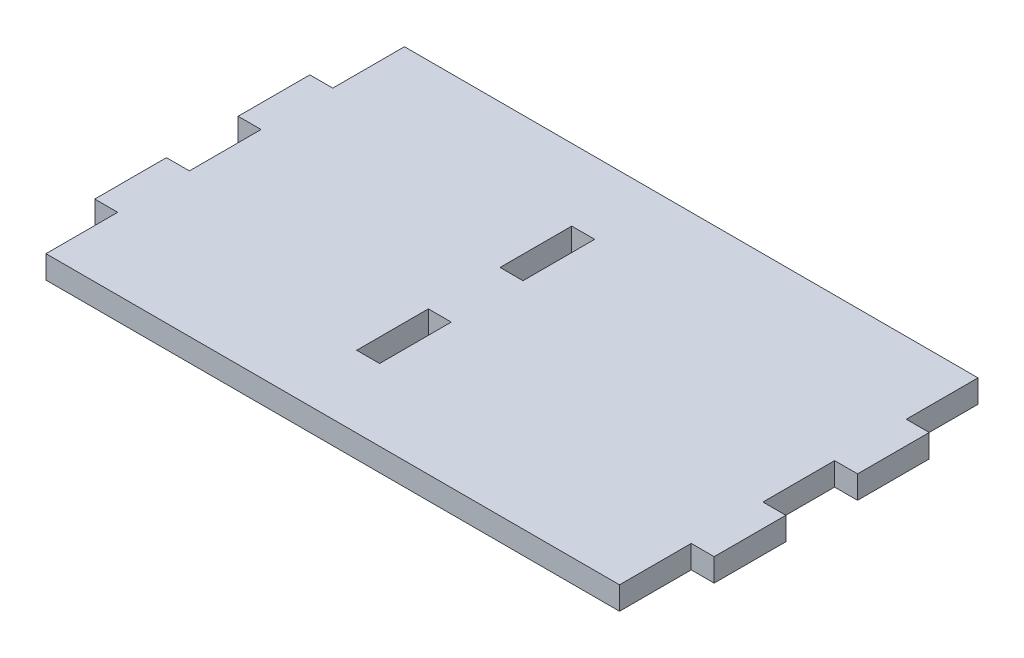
ISO-10303-21;
HEADER;
FILE_DESCRIPTION(('STEP AP214'),'2;1');
FILE_NAME('part.step','',(''),(''),'','','');
FILE_SCHEMA(('AUTOMOTIVE_DESIGN { 1 0 10303 214 1 1 1 1 }'));
ENDSEC;
DATA;
#1=APPLICATION_CONTEXT('core data for automotive mechanical design processes');
#2=APPLICATION_PROTOCOL_DEFINITION('international standard','automotive_design',2000,#1);
#3=PRODUCT_CONTEXT('',#1,'mechanical');
#4=PRODUCT('Part','Part','',(#3));
#5=PRODUCT_RELATED_PRODUCT_CATEGORY('part','',(#4));
#6=PRODUCT_DEFINITION_FORMATION('','',#4);
#7=PRODUCT_DEFINITION_CONTEXT('part definition',#1,'design');
#8=PRODUCT_DEFINITION('design','',#6,#7);
#9=PRODUCT_DEFINITION_SHAPE('','',#8);
#10=(LENGTH_UNIT() NAMED_UNIT(*) SI_UNIT(.MILLI.,.METRE.));
#11=(NAMED_UNIT(*) PLANE_ANGLE_UNIT() SI_UNIT($,.RADIAN.));
#12=(NAMED_UNIT(*) SI_UNIT($,.STERADIAN.) SOLID_ANGLE_UNIT());
#13=UNCERTAINTY_MEASURE_WITH_UNIT(LENGTH_MEASURE(1.E-05),#10,'distance_accuracy_value','');
#14=(GEOMETRIC_REPRESENTATION_CONTEXT(3) GLOBAL_UNCERTAINTY_ASSIGNED_CONTEXT((#13)) GLOBAL_UNIT_ASSIGNED_CONTEXT((#10,
#11,#12)) REPRESENTATION_CONTEXT('',''));
#15=CARTESIAN_POINT('',(0.,0.,0.));
#16=DIRECTION('',(0.,0.,1.));
#17=DIRECTION('',(1.,0.,0.));
#18=AXIS2_PLACEMENT_3D('',#15,#16,#17);
#19=CARTESIAN_POINT('',(0.,12.,0.));
#20=DIRECTION('',(0.,-1.,0.));
#21=DIRECTION('',(0.,0.,-1.));
#22=AXIS2_PLACEMENT_3D('',#19,#20,#21);
#23=PLANE('',#22);
#24=DIRECTION('',(0.,0.,1.));
#25=VECTOR('',#24,1.);
#26=CARTESIAN_POINT('',(-25.,12.,-56.25));
#27=LINE('',#26,#25);
#28=CARTESIAN_POINT('',(-25.,12.,-56.25));
#29=VERTEX_POINT('',#28);
#30=CARTESIAN_POINT('',(-25.,12.,-18.75));
#31=VERTEX_POINT('',#30);
#32=EDGE_CURVE('E279',#29,#31,#27,.T.);
#33=ORIENTED_EDGE('',*,*,#32,.F.);
#34=DIRECTION('',(-1.,0.,0.));
#35=VECTOR('',#34,1.);
#36=CARTESIAN_POINT('',(-25.,12.,-56.25));
#37=LINE('',#36,#35);
#38=CARTESIAN_POINT('',(-13.,12.,-56.25));
#39=VERTEX_POINT('',#38);
#40=EDGE_CURVE('E290',#39,#29,#37,.T.);
#41=ORIENTED_EDGE('',*,*,#40,.F.);
#42=DIRECTION('',(0.,0.,-1.));
#43=VECTOR('',#42,1.);
#44=CARTESIAN_POINT('',(-13.,12.,-56.25));
#45=LINE('',#44,#43);
#46=CARTESIAN_POINT('',(-13.,12.,-18.75));
#47=VERTEX_POINT('',#46);
#48=EDGE_CURVE('E286',#47,#39,#45,.T.);
#49=ORIENTED_EDGE('',*,*,#48,.F.);
#50=DIRECTION('',(1.,0.,0.));
#51=VECTOR('',#50,1.);
#52=CARTESIAN_POINT('',(-25.,12.,-18.75));
#53=LINE('',#52,#51);
#54=EDGE_CURVE('E282',#31,#47,#53,.T.);
#55=ORIENTED_EDGE('',*,*,#54,.F.);
#56=EDGE_LOOP('',(#33,#41,#49,#55));
#57=FACE_BOUND('',#56,.T.);
#58=DIRECTION('',(0.,0.,-1.));
#59=VECTOR('',#58,1.);
#60=CARTESIAN_POINT('',(150.,12.,-56.25));
#61=LINE('',#60,#59);
#62=CARTESIAN_POINT('',(150.,12.,-56.25));
#63=VERTEX_POINT('',#62);
#64=CARTESIAN_POINT('',(150.,12.,-93.75));
#65=VERTEX_POINT('',#64);
#66=EDGE_CURVE('E322',#63,#65,#61,.T.);
#67=ORIENTED_EDGE('',*,*,#66,.T.);
#68=DIRECTION('',(-1.,0.,0.));
#69=VECTOR('',#68,1.);
#70=CARTESIAN_POINT('',(-150.,12.,-93.75));
#71=LINE('',#70,#69);
#72=CARTESIAN_POINT('',(-150.,12.,-93.75));
#73=VERTEX_POINT('',#72);
#74=EDGE_CURVE('E326',#65,#73,#71,.T.);
#75=ORIENTED_EDGE('',*,*,#74,.T.);
#76=DIRECTION('',(0.,0.,1.));
#77=VECTOR('',#76,1.);
#78=CARTESIAN_POINT('',(-150.,12.,-56.25));
#79=LINE('',#78,#77);
#80=CARTESIAN_POINT('',(-150.,12.,-56.25));
#81=VERTEX_POINT('',#80);
#82=EDGE_CURVE('E330',#73,#81,#79,.T.);
#83=ORIENTED_EDGE('',*,*,#82,.T.);
#84=DIRECTION('',(-1.,0.,0.));
#85=VECTOR('',#84,1.);
#86=CARTESIAN_POINT('',(-150.,12.,-56.25));
#87=LINE('',#86,#85);
#88=CARTESIAN_POINT('',(-162.,12.,-56.25));
#89=VERTEX_POINT('',#88);
#90=EDGE_CURVE('E333',#81,#89,#87,.T.);
#91=ORIENTED_EDGE('',*,*,#90,.T.);
#92=DIRECTION('',(0.,0.,1.));
#93=VECTOR('',#92,1.);
#94=CARTESIAN_POINT('',(-162.,12.,-18.75));
#95=LINE('',#94,#93);
#96=CARTESIAN_POINT('',(-162.,12.,-18.75));
#97=VERTEX_POINT('',#96);
#98=EDGE_CURVE('E336',#89,#97,#95,.T.);
#99=ORIENTED_EDGE('',*,*,#98,.T.);
#100=DIRECTION('',(1.,0.,0.));
#101=VECTOR('',#100,1.);
#102=CARTESIAN_POINT('',(-150.,12.,-18.75));
#103=LINE('',#102,#101);
#104=CARTESIAN_POINT('',(-150.,12.,-18.75));
#105=VERTEX_POINT('',#104);
#106=EDGE_CURVE('E339',#97,#105,#103,.T.);
#107=ORIENTED_EDGE('',*,*,#106,.T.);
#108=DIRECTION('',(0.,0.,1.));
#109=VECTOR('',#108,1.);
#110=CARTESIAN_POINT('',(-150.,12.,18.75));
#111=LINE('',#110,#109);
#112=CARTESIAN_POINT('',(-150.,12.,18.75));
#113=VERTEX_POINT('',#112);
#114=EDGE_CURVE('E342',#105,#113,#111,.T.);
#115=ORIENTED_EDGE('',*,*,#114,.T.);
#116=DIRECTION('',(-1.,0.,0.));
#117=VECTOR('',#116,1.);
#118=CARTESIAN_POINT('',(-150.,12.,18.75));
#119=LINE('',#118,#117);
#120=CARTESIAN_POINT('',(-162.,12.,18.75));
#121=VERTEX_POINT('',#120);
#122=EDGE_CURVE('E345',#113,#121,#119,.T.);
#123=ORIENTED_EDGE('',*,*,#122,.T.);
#124=DIRECTION('',(0.,0.,1.));
#125=VECTOR('',#124,1.);
#126=CARTESIAN_POINT('',(-162.,12.,56.25));
#127=LINE('',#126,#125);
#128=CARTESIAN_POINT('',(-162.,12.,56.25));
#129=VERTEX_POINT('',#128);
#130=EDGE_CURVE('E348',#121,#129,#127,.T.);
#131=ORIENTED_EDGE('',*,*,#130,.T.);
#132=DIRECTION('',(1.,0.,0.));
#133=VECTOR('',#132,1.);
#134=CARTESIAN_POINT('',(-150.,12.,56.25));
#135=LINE('',#134,#133);
#136=CARTESIAN_POINT('',(-150.,12.,56.25));
#137=VERTEX_POINT('',#136);
#138=EDGE_CURVE('E351',#129,#137,#135,.T.);
#139=ORIENTED_EDGE('',*,*,#138,.T.);
#140=DIRECTION('',(0.,0.,1.));
#141=VECTOR('',#140,1.);
#142=CARTESIAN_POINT('',(-150.,12.,93.75));
#143=LINE('',#142,#141);
#144=CARTESIAN_POINT('',(-150.,12.,93.75));
#145=VERTEX_POINT('',#144);
#146=EDGE_CURVE('E354',#137,#145,#143,.T.);
#147=ORIENTED_EDGE('',*,*,#146,.T.);
#148=DIRECTION('',(1.,0.,0.));
#149=VECTOR('',#148,1.);
#150=CARTESIAN_POINT('',(-150.,12.,93.75));
#151=LINE('',#150,#149);
#152=CARTESIAN_POINT('',(150.,12.,93.75));
#153=VERTEX_POINT('',#152);
#154=EDGE_CURVE('E357',#145,#153,#151,.T.);
#155=ORIENTED_EDGE('',*,*,#154,.T.);
#156=DIRECTION('',(0.,0.,-1.));
#157=VECTOR('',#156,1.);
#158=CARTESIAN_POINT('',(150.,12.,93.75));
#159=LINE('',#158,#157);
#160=CARTESIAN_POINT('',(150.,12.,56.25));
#161=VERTEX_POINT('',#160);
#162=EDGE_CURVE('E360',#153,#161,#159,.T.);
#163=ORIENTED_EDGE('',*,*,#162,.T.);
#164=DIRECTION('',(1.,0.,0.));
#165=VECTOR('',#164,1.);
#166=CARTESIAN_POINT('',(150.,12.,56.25));
#167=LINE('',#166,#165);
#168=CARTESIAN_POINT('',(162.,12.,56.25));
#169=VERTEX_POINT('',#168);
#170=EDGE_CURVE('E363',#161,#169,#167,.T.);
#171=ORIENTED_EDGE('',*,*,#170,.T.);
#172=DIRECTION('',(0.,0.,-1.));
#173=VECTOR('',#172,1.);
#174=CARTESIAN_POINT('',(162.,12.,56.25));
#175=LINE('',#174,#173);
#176=CARTESIAN_POINT('',(162.,12.,18.75));
#177=VERTEX_POINT('',#176);
#178=EDGE_CURVE('E366',#169,#177,#175,.T.);
#179=ORIENTED_EDGE('',*,*,#178,.T.);
#180=DIRECTION('',(-1.,0.,0.));
#181=VECTOR('',#180,1.);
#182=CARTESIAN_POINT('',(150.,12.,18.75));
#183=LINE('',#182,#181);
#184=CARTESIAN_POINT('',(150.,12.,18.75));
#185=VERTEX_POINT('',#184);
#186=EDGE_CURVE('E369',#177,#185,#183,.T.);
#187=ORIENTED_EDGE('',*,*,#186,.T.);
#188=DIRECTION('',(0.,0.,-1.));
#189=VECTOR('',#188,1.);
#190=CARTESIAN_POINT('',(150.,12.,18.75));
#191=LINE('',#190,#189);
#192=CARTESIAN_POINT('',(150.,12.,-18.75));
#193=VERTEX_POINT('',#192);
#194=EDGE_CURVE('E372',#185,#193,#191,.T.);
#195=ORIENTED_EDGE('',*,*,#194,.T.);
#196=DIRECTION('',(1.,0.,0.));
#197=VECTOR('',#196,1.);
#198=CARTESIAN_POINT('',(150.,12.,-18.75));
#199=LINE('',#198,#197);
#200=CARTESIAN_POINT('',(162.,12.,-18.75));
#201=VERTEX_POINT('',#200);
#202=EDGE_CURVE('E375',#193,#201,#199,.T.);
#203=ORIENTED_EDGE('',*,*,#202,.T.);
#204=DIRECTION('',(0.,0.,-1.));
#205=VECTOR('',#204,1.);
#206=CARTESIAN_POINT('',(162.,12.,-18.75));
#207=LINE('',#206,#205);
#208=CARTESIAN_POINT('',(162.,12.,-56.25));
#209=VERTEX_POINT('',#208);
#210=EDGE_CURVE('E378',#201,#209,#207,.T.);
#211=ORIENTED_EDGE('',*,*,#210,.T.);
#212=DIRECTION('',(-1.,0.,0.));
#213=VECTOR('',#212,1.);
#214=CARTESIAN_POINT('',(150.,12.,-56.25));
#215=LINE('',#214,#213);
#216=EDGE_CURVE('E381',#209,#63,#215,.T.);
#217=ORIENTED_EDGE('',*,*,#216,.T.);
#218=EDGE_LOOP('',(#67,#75,#83,#91,#99,#107,#115,#123,#131,#139,#147,#155,#163,#171,#179,#187,
#195,#203,#211,#217));
#219=FACE_BOUND('',#218,.T.);
#220=DIRECTION('',(-1.,0.,0.));
#221=VECTOR('',#220,1.);
#222=CARTESIAN_POINT('',(-24.9999999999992,12.,18.75));
#223=LINE('',#222,#221);
#224=CARTESIAN_POINT('',(-12.9999999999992,12.,18.75));
#225=VERTEX_POINT('',#224);
#226=CARTESIAN_POINT('',(-24.9999999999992,12.,18.75));
#227=VERTEX_POINT('',#226);
#228=EDGE_CURVE('E231',#225,#227,#223,.T.);
#229=ORIENTED_EDGE('',*,*,#228,.F.);
#230=DIRECTION('',(0.,0.,-1.));
#231=VECTOR('',#230,1.);
#232=CARTESIAN_POINT('',(-12.9999999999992,12.,18.75));
#233=LINE('',#232,#231);
#234=CARTESIAN_POINT('',(-12.9999999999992,12.,56.25));
#235=VERTEX_POINT('',#234);
#236=EDGE_CURVE('E257',#235,#225,#233,.T.);
#237=ORIENTED_EDGE('',*,*,#236,.F.);
#238=DIRECTION('',(1.,0.,0.));
#239=VECTOR('',#238,1.);
#240=CARTESIAN_POINT('',(-24.9999999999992,12.,56.25));
#241=LINE('',#240,#239);
#242=CARTESIAN_POINT('',(-24.9999999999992,12.,56.25));
#243=VERTEX_POINT('',#242);
#244=EDGE_CURVE('E253',#243,#235,#241,.T.);
#245=ORIENTED_EDGE('',*,*,#244,.F.);
#246=DIRECTION('',(0.,0.,1.));
#247=VECTOR('',#246,1.);
#248=CARTESIAN_POINT('',(-24.9999999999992,12.,18.75));
#249=LINE('',#248,#247);
#250=EDGE_CURVE('E240',#227,#243,#249,.T.);
#251=ORIENTED_EDGE('',*,*,#250,.F.);
#252=EDGE_LOOP('',(#229,#237,#245,#251));
#253=FACE_BOUND('',#252,.T.);
#254=ADVANCED_FACE('F45',(#57,#219,#253),#23,.F.);
#255=CARTESIAN_POINT('',(0.,0.,0.));
#256=DIRECTION('',(0.,-1.,0.));
#257=DIRECTION('',(0.,0.,-1.));
#258=AXIS2_PLACEMENT_3D('',#255,#256,#257);
#259=PLANE('',#258);
#260=DIRECTION('',(0.,0.,-1.));
#261=VECTOR('',#260,1.);
#262=CARTESIAN_POINT('',(150.,0.,-56.25));
#263=LINE('',#262,#261);
#264=CARTESIAN_POINT('',(150.,0.,-56.25));
#265=VERTEX_POINT('',#264);
#266=CARTESIAN_POINT('',(150.,0.,-93.75));
#267=VERTEX_POINT('',#266);
#268=EDGE_CURVE('E321',#265,#267,#263,.T.);
#269=ORIENTED_EDGE('',*,*,#268,.F.);
#270=DIRECTION('',(-1.,0.,0.));
#271=VECTOR('',#270,1.);
#272=CARTESIAN_POINT('',(150.,0.,-56.25));
#273=LINE('',#272,#271);
#274=CARTESIAN_POINT('',(162.,0.,-56.25));
#275=VERTEX_POINT('',#274);
#276=EDGE_CURVE('E327',#275,#265,#273,.T.);
#277=ORIENTED_EDGE('',*,*,#276,.F.);
#278=DIRECTION('',(0.,0.,-1.));
#279=VECTOR('',#278,1.);
#280=CARTESIAN_POINT('',(162.,0.,-18.75));
#281=LINE('',#280,#279);
#282=CARTESIAN_POINT('',(162.,0.,-18.75));
#283=VERTEX_POINT('',#282);
#284=EDGE_CURVE('E439',#283,#275,#281,.T.);
#285=ORIENTED_EDGE('',*,*,#284,.F.);
#286=DIRECTION('',(1.,0.,0.));
#287=VECTOR('',#286,1.);
#288=CARTESIAN_POINT('',(150.,0.,-18.75));
#289=LINE('',#288,#287);
#290=CARTESIAN_POINT('',(150.,0.,-18.75));
#291=VERTEX_POINT('',#290);
#292=EDGE_CURVE('E436',#291,#283,#289,.T.);
#293=ORIENTED_EDGE('',*,*,#292,.F.);
#294=DIRECTION('',(0.,0.,-1.));
#295=VECTOR('',#294,1.);
#296=CARTESIAN_POINT('',(150.,0.,18.75));
#297=LINE('',#296,#295);
#298=CARTESIAN_POINT('',(150.,0.,18.75));
#299=VERTEX_POINT('',#298);
#300=EDGE_CURVE('E433',#299,#291,#297,.T.);
#301=ORIENTED_EDGE('',*,*,#300,.F.);
#302=DIRECTION('',(-1.,0.,0.));
#303=VECTOR('',#302,1.);
#304=CARTESIAN_POINT('',(150.,0.,18.75));
#305=LINE('',#304,#303);
#306=CARTESIAN_POINT('',(162.,0.,18.75));
#307=VERTEX_POINT('',#306);
#308=EDGE_CURVE('E430',#307,#299,#305,.T.);
#309=ORIENTED_EDGE('',*,*,#308,.F.);
#310=DIRECTION('',(0.,0.,-1.));
#311=VECTOR('',#310,1.);
#312=CARTESIAN_POINT('',(162.,0.,56.25));
#313=LINE('',#312,#311);
#314=CARTESIAN_POINT('',(162.,0.,56.25));
#315=VERTEX_POINT('',#314);
#316=EDGE_CURVE('E427',#315,#307,#313,.T.);
#317=ORIENTED_EDGE('',*,*,#316,.F.);
#318=DIRECTION('',(1.,0.,0.));
#319=VECTOR('',#318,1.);
#320=CARTESIAN_POINT('',(150.,0.,56.25));
#321=LINE('',#320,#319);
#322=CARTESIAN_POINT('',(150.,0.,56.25));
#323=VERTEX_POINT('',#322);
#324=EDGE_CURVE('E424',#323,#315,#321,.T.);
#325=ORIENTED_EDGE('',*,*,#324,.F.);
#326=DIRECTION('',(0.,0.,-1.));
#327=VECTOR('',#326,1.);
#328=CARTESIAN_POINT('',(150.,0.,93.75));
#329=LINE('',#328,#327);
#330=CARTESIAN_POINT('',(150.,0.,93.75));
#331=VERTEX_POINT('',#330);
#332=EDGE_CURVE('E421',#331,#323,#329,.T.);
#333=ORIENTED_EDGE('',*,*,#332,.F.);
#334=DIRECTION('',(1.,0.,0.));
#335=VECTOR('',#334,1.);
#336=CARTESIAN_POINT('',(-150.,0.,93.75));
#337=LINE('',#336,#335);
#338=CARTESIAN_POINT('',(-150.,0.,93.75));
#339=VERTEX_POINT('',#338);
#340=EDGE_CURVE('E418',#339,#331,#337,.T.);
#341=ORIENTED_EDGE('',*,*,#340,.F.);
#342=DIRECTION('',(0.,0.,1.));
#343=VECTOR('',#342,1.);
#344=CARTESIAN_POINT('',(-150.,0.,93.75));
#345=LINE('',#344,#343);
#346=CARTESIAN_POINT('',(-150.,0.,56.25));
#347=VERTEX_POINT('',#346);
#348=EDGE_CURVE('E415',#347,#339,#345,.T.);
#349=ORIENTED_EDGE('',*,*,#348,.F.);
#350=DIRECTION('',(1.,0.,0.));
#351=VECTOR('',#350,1.);
#352=CARTESIAN_POINT('',(-150.,0.,56.25));
#353=LINE('',#352,#351);
#354=CARTESIAN_POINT('',(-162.,0.,56.25));
#355=VERTEX_POINT('',#354);
#356=EDGE_CURVE('E412',#355,#347,#353,.T.);
#357=ORIENTED_EDGE('',*,*,#356,.F.);
#358=DIRECTION('',(0.,0.,1.));
#359=VECTOR('',#358,1.);
#360=CARTESIAN_POINT('',(-162.,0.,56.25));
#361=LINE('',#360,#359);
#362=CARTESIAN_POINT('',(-162.,0.,18.75));
#363=VERTEX_POINT('',#362);
#364=EDGE_CURVE('E409',#363,#355,#361,.T.);
#365=ORIENTED_EDGE('',*,*,#364,.F.);
#366=DIRECTION('',(-1.,0.,0.));
#367=VECTOR('',#366,1.);
#368=CARTESIAN_POINT('',(-150.,0.,18.75));
#369=LINE('',#368,#367);
#370=CARTESIAN_POINT('',(-150.,0.,18.75));
#371=VERTEX_POINT('',#370);
#372=EDGE_CURVE('E406',#371,#363,#369,.T.);
#373=ORIENTED_EDGE('',*,*,#372,.F.);
#374=DIRECTION('',(0.,0.,1.));
#375=VECTOR('',#374,1.);
#376=CARTESIAN_POINT('',(-150.,0.,18.75));
#377=LINE('',#376,#375);
#378=CARTESIAN_POINT('',(-150.,0.,-18.75));
#379=VERTEX_POINT('',#378);
#380=EDGE_CURVE('E403',#379,#371,#377,.T.);
#381=ORIENTED_EDGE('',*,*,#380,.F.);
#382=DIRECTION('',(1.,0.,0.));
#383=VECTOR('',#382,1.);
#384=CARTESIAN_POINT('',(-150.,0.,-18.75));
#385=LINE('',#384,#383);
#386=CARTESIAN_POINT('',(-162.,0.,-18.75));
#387=VERTEX_POINT('',#386);
#388=EDGE_CURVE('E400',#387,#379,#385,.T.);
#389=ORIENTED_EDGE('',*,*,#388,.F.);
#390=DIRECTION('',(0.,0.,1.));
#391=VECTOR('',#390,1.);
#392=CARTESIAN_POINT('',(-162.,0.,-18.75));
#393=LINE('',#392,#391);
#394=CARTESIAN_POINT('',(-162.,0.,-56.25));
#395=VERTEX_POINT('',#394);
#396=EDGE_CURVE('E397',#395,#387,#393,.T.);
#397=ORIENTED_EDGE('',*,*,#396,.F.);
#398=DIRECTION('',(-1.,0.,0.));
#399=VECTOR('',#398,1.);
#400=CARTESIAN_POINT('',(-150.,0.,-56.25));
#401=LINE('',#400,#399);
#402=CARTESIAN_POINT('',(-150.,0.,-56.25));
#403=VERTEX_POINT('',#402);
#404=EDGE_CURVE('E394',#403,#395,#401,.T.);
#405=ORIENTED_EDGE('',*,*,#404,.F.);
#406=DIRECTION('',(0.,0.,1.));
#407=VECTOR('',#406,1.);
#408=CARTESIAN_POINT('',(-150.,0.,-56.25));
#409=LINE('',#408,#407);
#410=CARTESIAN_POINT('',(-150.,0.,-93.75));
#411=VERTEX_POINT('',#410);
#412=EDGE_CURVE('E391',#411,#403,#409,.T.);
#413=ORIENTED_EDGE('',*,*,#412,.F.);
#414=DIRECTION('',(-1.,0.,0.));
#415=VECTOR('',#414,1.);
#416=CARTESIAN_POINT('',(-150.,0.,-93.75));
#417=LINE('',#416,#415);
#418=EDGE_CURVE('E388',#267,#411,#417,.T.);
#419=ORIENTED_EDGE('',*,*,#418,.F.);
#420=EDGE_LOOP('',(#269,#277,#285,#293,#301,#309,#317,#325,#333,#341,#349,#357,#365,#373,#381,
#389,#397,#405,#413,#419));
#421=FACE_BOUND('',#420,.T.);
#422=DIRECTION('',(-1.,0.,0.));
#423=VECTOR('',#422,1.);
#424=CARTESIAN_POINT('',(-25.,0.,-56.25));
#425=LINE('',#424,#423);
#426=CARTESIAN_POINT('',(-13.,0.,-56.25));
#427=VERTEX_POINT('',#426);
#428=CARTESIAN_POINT('',(-25.,0.,-56.25));
#429=VERTEX_POINT('',#428);
#430=EDGE_CURVE('E283',#427,#429,#425,.T.);
#431=ORIENTED_EDGE('',*,*,#430,.T.);
#432=DIRECTION('',(0.,0.,1.));
#433=VECTOR('',#432,1.);
#434=CARTESIAN_POINT('',(-25.,0.,-56.25));
#435=LINE('',#434,#433);
#436=CARTESIAN_POINT('',(-25.,0.,-18.75));
#437=VERTEX_POINT('',#436);
#438=EDGE_CURVE('E249',#429,#437,#435,.T.);
#439=ORIENTED_EDGE('',*,*,#438,.T.);
#440=DIRECTION('',(1.,0.,0.));
#441=VECTOR('',#440,1.);
#442=CARTESIAN_POINT('',(-25.,0.,-18.75));
#443=LINE('',#442,#441);
#444=CARTESIAN_POINT('',(-13.,0.,-18.75));
#445=VERTEX_POINT('',#444);
#446=EDGE_CURVE('E297',#437,#445,#443,.T.);
#447=ORIENTED_EDGE('',*,*,#446,.T.);
#448=DIRECTION('',(0.,0.,-1.));
#449=VECTOR('',#448,1.);
#450=CARTESIAN_POINT('',(-13.,0.,-56.25));
#451=LINE('',#450,#449);
#452=EDGE_CURVE('E301',#445,#427,#451,.T.);
#453=ORIENTED_EDGE('',*,*,#452,.T.);
#454=EDGE_LOOP('',(#431,#439,#447,#453));
#455=FACE_BOUND('',#454,.T.);
#456=DIRECTION('',(0.,0.,-1.));
#457=VECTOR('',#456,1.);
#458=CARTESIAN_POINT('',(-12.9999999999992,0.,18.75));
#459=LINE('',#458,#457);
#460=CARTESIAN_POINT('',(-12.9999999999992,0.,56.25));
#461=VERTEX_POINT('',#460);
#462=CARTESIAN_POINT('',(-12.9999999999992,0.,18.75));
#463=VERTEX_POINT('',#462);
#464=EDGE_CURVE('E241',#461,#463,#459,.T.);
#465=ORIENTED_EDGE('',*,*,#464,.T.);
#466=DIRECTION('',(-1.,0.,0.));
#467=VECTOR('',#466,1.);
#468=CARTESIAN_POINT('',(-24.9999999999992,0.,18.75));
#469=LINE('',#468,#467);
#470=CARTESIAN_POINT('',(-24.9999999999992,0.,18.75));
#471=VERTEX_POINT('',#470);
#472=EDGE_CURVE('E69',#463,#471,#469,.T.);
#473=ORIENTED_EDGE('',*,*,#472,.T.);
#474=DIRECTION('',(0.,0.,1.));
#475=VECTOR('',#474,1.);
#476=CARTESIAN_POINT('',(-24.9999999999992,0.,18.75));
#477=LINE('',#476,#475);
#478=CARTESIAN_POINT('',(-24.9999999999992,0.,56.25));
#479=VERTEX_POINT('',#478);
#480=EDGE_CURVE('E247',#471,#479,#477,.T.);
#481=ORIENTED_EDGE('',*,*,#480,.T.);
#482=DIRECTION('',(1.,0.,0.));
#483=VECTOR('',#482,1.);
#484=CARTESIAN_POINT('',(-24.9999999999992,0.,56.25));
#485=LINE('',#484,#483);
#486=EDGE_CURVE('E266',#479,#461,#485,.T.);
#487=ORIENTED_EDGE('',*,*,#486,.T.);
#488=EDGE_LOOP('',(#465,#473,#481,#487));
#489=FACE_BOUND('',#488,.T.);
#490=ADVANCED_FACE('F526',(#421,#455,#489),#259,.T.);
#491=CARTESIAN_POINT('',(150.,12.,-56.25));
#492=DIRECTION('',(-1.,0.,0.));
#493=DIRECTION('',(0.,0.,1.));
#494=AXIS2_PLACEMENT_3D('',#491,#492,#493);
#495=PLANE('',#494);
#496=ORIENTED_EDGE('',*,*,#268,.T.);
#497=DIRECTION('',(0.,-1.,0.));
#498=VECTOR('',#497,1.);
#499=CARTESIAN_POINT('',(150.,12.,-93.75));
#500=LINE('',#499,#498);
#501=EDGE_CURVE('E11',#65,#267,#500,.T.);
#502=ORIENTED_EDGE('',*,*,#501,.F.);
#503=ORIENTED_EDGE('',*,*,#66,.F.);
#504=DIRECTION('',(0.,-1.,0.));
#505=VECTOR('',#504,1.);
#506=CARTESIAN_POINT('',(150.,12.,-56.25));
#507=LINE('',#506,#505);
#508=EDGE_CURVE('E384',#63,#265,#507,.T.);
#509=ORIENTED_EDGE('',*,*,#508,.T.);
#510=EDGE_LOOP('',(#496,#502,#503,#509));
#511=FACE_BOUND('',#510,.T.);
#512=ADVANCED_FACE('F47',(#511),#495,.F.);
#513=CARTESIAN_POINT('',(-150.,12.,-93.75));
#514=DIRECTION('',(0.,0.,1.));
#515=DIRECTION('',(1.,0.,0.));
#516=AXIS2_PLACEMENT_3D('',#513,#514,#515);
#517=PLANE('',#516);
#518=ORIENTED_EDGE('',*,*,#418,.T.);
#519=DIRECTION('',(0.,-1.,0.));
#520=VECTOR('',#519,1.);
#521=CARTESIAN_POINT('',(-150.,12.,-93.75));
#522=LINE('',#521,#520);
#523=EDGE_CURVE('E54',#73,#411,#522,.T.);
#524=ORIENTED_EDGE('',*,*,#523,.F.);
#525=ORIENTED_EDGE('',*,*,#74,.F.);
#526=ORIENTED_EDGE('',*,*,#501,.T.);
#527=EDGE_LOOP('',(#518,#524,#525,#526));
#528=FACE_BOUND('',#527,.T.);
#529=ADVANCED_FACE('F543',(#528),#517,.F.);
#530=CARTESIAN_POINT('',(-150.,12.,-56.25));
#531=DIRECTION('',(1.,0.,0.));
#532=DIRECTION('',(0.,0.,-1.));
#533=AXIS2_PLACEMENT_3D('',#530,#531,#532);
#534=PLANE('',#533);
#535=ORIENTED_EDGE('',*,*,#412,.T.);
#536=DIRECTION('',(0.,-1.,0.));
#537=VECTOR('',#536,1.);
#538=CARTESIAN_POINT('',(-150.,12.,-56.25));
#539=LINE('',#538,#537);
#540=EDGE_CURVE('E511',#81,#403,#539,.T.);
#541=ORIENTED_EDGE('',*,*,#540,.F.);
#542=ORIENTED_EDGE('',*,*,#82,.F.);
#543=ORIENTED_EDGE('',*,*,#523,.T.);
#544=EDGE_LOOP('',(#535,#541,#542,#543));
#545=FACE_BOUND('',#544,.T.);
#546=ADVANCED_FACE('F520',(#545),#534,.F.);
#547=CARTESIAN_POINT('',(-150.,12.,-56.25));
#548=DIRECTION('',(0.,0.,1.));
#549=DIRECTION('',(1.,0.,0.));
#550=AXIS2_PLACEMENT_3D('',#547,#548,#549);
#551=PLANE('',#550);
#552=ORIENTED_EDGE('',*,*,#404,.T.);
#553=DIRECTION('',(0.,-1.,0.));
#554=VECTOR('',#553,1.);
#555=CARTESIAN_POINT('',(-162.,12.,-56.25));
#556=LINE('',#555,#554);
#557=EDGE_CURVE('E507',#89,#395,#556,.T.);
#558=ORIENTED_EDGE('',*,*,#557,.F.);
#559=ORIENTED_EDGE('',*,*,#90,.F.);
#560=ORIENTED_EDGE('',*,*,#540,.T.);
#561=EDGE_LOOP('',(#552,#558,#559,#560));
#562=FACE_BOUND('',#561,.T.);
#563=ADVANCED_FACE('F532',(#562),#551,.F.);
#564=CARTESIAN_POINT('',(-162.,12.,-18.75));
#565=DIRECTION('',(1.,0.,0.));
#566=DIRECTION('',(0.,0.,-1.));
#567=AXIS2_PLACEMENT_3D('',#564,#565,#566);
#568=PLANE('',#567);
#569=ORIENTED_EDGE('',*,*,#396,.T.);
#570=DIRECTION('',(0.,-1.,0.));
#571=VECTOR('',#570,1.);
#572=CARTESIAN_POINT('',(-162.,12.,-18.75));
#573=LINE('',#572,#571);
#574=EDGE_CURVE('E503',#97,#387,#573,.T.);
#575=ORIENTED_EDGE('',*,*,#574,.F.);
#576=ORIENTED_EDGE('',*,*,#98,.F.);
#577=ORIENTED_EDGE('',*,*,#557,.T.);
#578=EDGE_LOOP('',(#569,#575,#576,#577));
#579=FACE_BOUND('',#578,.T.);
#580=ADVANCED_FACE('F536',(#579),#568,.F.);
#581=CARTESIAN_POINT('',(-150.,12.,-18.75));
#582=DIRECTION('',(0.,0.,-1.));
#583=DIRECTION('',(-1.,0.,0.));
#584=AXIS2_PLACEMENT_3D('',#581,#582,#583);
#585=PLANE('',#584);
#586=ORIENTED_EDGE('',*,*,#388,.T.);
#587=DIRECTION('',(0.,-1.,0.));
#588=VECTOR('',#587,1.);
#589=CARTESIAN_POINT('',(-150.,12.,-18.75));
#590=LINE('',#589,#588);
#591=EDGE_CURVE('E499',#105,#379,#590,.T.);
#592=ORIENTED_EDGE('',*,*,#591,.F.);
#593=ORIENTED_EDGE('',*,*,#106,.F.);
#594=ORIENTED_EDGE('',*,*,#574,.T.);
#595=EDGE_LOOP('',(#586,#592,#593,#594));
#596=FACE_BOUND('',#595,.T.);
#597=ADVANCED_FACE('F616',(#596),#585,.F.);
#598=CARTESIAN_POINT('',(-150.,12.,18.75));
#599=DIRECTION('',(1.,0.,0.));
#600=DIRECTION('',(0.,0.,-1.));
#601=AXIS2_PLACEMENT_3D('',#598,#599,#600);
#602=PLANE('',#601);
#603=ORIENTED_EDGE('',*,*,#380,.T.);
#604=DIRECTION('',(0.,-1.,0.));
#605=VECTOR('',#604,1.);
#606=CARTESIAN_POINT('',(-150.,12.,18.75));
#607=LINE('',#606,#605);
#608=EDGE_CURVE('E495',#113,#371,#607,.T.);
#609=ORIENTED_EDGE('',*,*,#608,.F.);
#610=ORIENTED_EDGE('',*,*,#114,.F.);
#611=ORIENTED_EDGE('',*,*,#591,.T.);
#612=EDGE_LOOP('',(#603,#609,#610,#611));
#613=FACE_BOUND('',#612,.T.);
#614=ADVANCED_FACE('F614',(#613),#602,.F.);
#615=CARTESIAN_POINT('',(-150.,12.,18.75));
#616=DIRECTION('',(0.,0.,1.));
#617=DIRECTION('',(1.,0.,0.));
#618=AXIS2_PLACEMENT_3D('',#615,#616,#617);
#619=PLANE('',#618);
#620=ORIENTED_EDGE('',*,*,#372,.T.);
#621=DIRECTION('',(0.,-1.,0.));
#622=VECTOR('',#621,1.);
#623=CARTESIAN_POINT('',(-162.,12.,18.75));
#624=LINE('',#623,#622);
#625=EDGE_CURVE('E491',#121,#363,#624,.T.);
#626=ORIENTED_EDGE('',*,*,#625,.F.);
#627=ORIENTED_EDGE('',*,*,#122,.F.);
#628=ORIENTED_EDGE('',*,*,#608,.T.);
#629=EDGE_LOOP('',(#620,#626,#627,#628));
#630=FACE_BOUND('',#629,.T.);
#631=ADVANCED_FACE('F609',(#630),#619,.F.);
#632=CARTESIAN_POINT('',(-162.,12.,56.25));
#633=DIRECTION('',(1.,0.,0.));
#634=DIRECTION('',(0.,0.,-1.));
#635=AXIS2_PLACEMENT_3D('',#632,#633,#634);
#636=PLANE('',#635);
#637=ORIENTED_EDGE('',*,*,#364,.T.);
#638=DIRECTION('',(0.,-1.,0.));
#639=VECTOR('',#638,1.);
#640=CARTESIAN_POINT('',(-162.,12.,56.25));
#641=LINE('',#640,#639);
#642=EDGE_CURVE('E487',#129,#355,#641,.T.);
#643=ORIENTED_EDGE('',*,*,#642,.F.);
#644=ORIENTED_EDGE('',*,*,#130,.F.);
#645=ORIENTED_EDGE('',*,*,#625,.T.);
#646=EDGE_LOOP('',(#637,#643,#644,#645));
#647=FACE_BOUND('',#646,.T.);
#648=ADVANCED_FACE('F604',(#647),#636,.F.);
#649=CARTESIAN_POINT('',(-150.,12.,56.25));
#650=DIRECTION('',(0.,0.,-1.));
#651=DIRECTION('',(-1.,0.,0.));
#652=AXIS2_PLACEMENT_3D('',#649,#650,#651);
#653=PLANE('',#652);
#654=ORIENTED_EDGE('',*,*,#356,.T.);
#655=DIRECTION('',(0.,-1.,0.));
#656=VECTOR('',#655,1.);
#657=CARTESIAN_POINT('',(-150.,12.,56.25));
#658=LINE('',#657,#656);
#659=EDGE_CURVE('E483',#137,#347,#658,.T.);
#660=ORIENTED_EDGE('',*,*,#659,.F.);
#661=ORIENTED_EDGE('',*,*,#138,.F.);
#662=ORIENTED_EDGE('',*,*,#642,.T.);
#663=EDGE_LOOP('',(#654,#660,#661,#662));
#664=FACE_BOUND('',#663,.T.);
#665=ADVANCED_FACE('F600',(#664),#653,.F.);
#666=CARTESIAN_POINT('',(-150.,12.,93.75));
#667=DIRECTION('',(1.,0.,0.));
#668=DIRECTION('',(0.,0.,-1.));
#669=AXIS2_PLACEMENT_3D('',#666,#667,#668);
#670=PLANE('',#669);
#671=ORIENTED_EDGE('',*,*,#348,.T.);
#672=DIRECTION('',(0.,-1.,0.));
#673=VECTOR('',#672,1.);
#674=CARTESIAN_POINT('',(-150.,12.,93.75));
#675=LINE('',#674,#673);
#676=EDGE_CURVE('E479',#145,#339,#675,.T.);
#677=ORIENTED_EDGE('',*,*,#676,.F.);
#678=ORIENTED_EDGE('',*,*,#146,.F.);
#679=ORIENTED_EDGE('',*,*,#659,.T.);
#680=EDGE_LOOP('',(#671,#677,#678,#679));
#681=FACE_BOUND('',#680,.T.);
#682=ADVANCED_FACE('F595',(#681),#670,.F.);
#683=CARTESIAN_POINT('',(-150.,12.,93.75));
#684=DIRECTION('',(0.,0.,-1.));
#685=DIRECTION('',(-1.,0.,0.));
#686=AXIS2_PLACEMENT_3D('',#683,#684,#685);
#687=PLANE('',#686);
#688=ORIENTED_EDGE('',*,*,#340,.T.);
#689=DIRECTION('',(0.,-1.,0.));
#690=VECTOR('',#689,1.);
#691=CARTESIAN_POINT('',(150.,12.,93.75));
#692=LINE('',#691,#690);
#693=EDGE_CURVE('E475',#153,#331,#692,.T.);
#694=ORIENTED_EDGE('',*,*,#693,.F.);
#695=ORIENTED_EDGE('',*,*,#154,.F.);
#696=ORIENTED_EDGE('',*,*,#676,.T.);
#697=EDGE_LOOP('',(#688,#694,#695,#696));
#698=FACE_BOUND('',#697,.T.);
#699=ADVANCED_FACE('F589',(#698),#687,.F.);
#700=CARTESIAN_POINT('',(150.,12.,93.75));
#701=DIRECTION('',(-1.,0.,0.));
#702=DIRECTION('',(0.,0.,1.));
#703=AXIS2_PLACEMENT_3D('',#700,#701,#702);
#704=PLANE('',#703);
#705=ORIENTED_EDGE('',*,*,#332,.T.);
#706=DIRECTION('',(0.,-1.,0.));
#707=VECTOR('',#706,1.);
#708=CARTESIAN_POINT('',(150.,12.,56.25));
#709=LINE('',#708,#707);
#710=EDGE_CURVE('E471',#161,#323,#709,.T.);
#711=ORIENTED_EDGE('',*,*,#710,.F.);
#712=ORIENTED_EDGE('',*,*,#162,.F.);
#713=ORIENTED_EDGE('',*,*,#693,.T.);
#714=EDGE_LOOP('',(#705,#711,#712,#713));
#715=FACE_BOUND('',#714,.T.);
#716=ADVANCED_FACE('F585',(#715),#704,.F.);
#717=CARTESIAN_POINT('',(150.,12.,56.25));
#718=DIRECTION('',(0.,0.,-1.));
#719=DIRECTION('',(-1.,0.,0.));
#720=AXIS2_PLACEMENT_3D('',#717,#718,#719);
#721=PLANE('',#720);
#722=ORIENTED_EDGE('',*,*,#324,.T.);
#723=DIRECTION('',(0.,-1.,0.));
#724=VECTOR('',#723,1.);
#725=CARTESIAN_POINT('',(162.,12.,56.25));
#726=LINE('',#725,#724);
#727=EDGE_CURVE('E467',#169,#315,#726,.T.);
#728=ORIENTED_EDGE('',*,*,#727,.F.);
#729=ORIENTED_EDGE('',*,*,#170,.F.);
#730=ORIENTED_EDGE('',*,*,#710,.T.);
#731=EDGE_LOOP('',(#722,#728,#729,#730));
#732=FACE_BOUND('',#731,.T.);
#733=ADVANCED_FACE('F580',(#732),#721,.F.);
#734=CARTESIAN_POINT('',(162.,12.,56.25));
#735=DIRECTION('',(-1.,0.,0.));
#736=DIRECTION('',(0.,0.,1.));
#737=AXIS2_PLACEMENT_3D('',#734,#735,#736);
#738=PLANE('',#737);
#739=ORIENTED_EDGE('',*,*,#316,.T.);
#740=DIRECTION('',(0.,-1.,0.));
#741=VECTOR('',#740,1.);
#742=CARTESIAN_POINT('',(162.,12.,18.75));
#743=LINE('',#742,#741);
#744=EDGE_CURVE('E463',#177,#307,#743,.T.);
#745=ORIENTED_EDGE('',*,*,#744,.F.);
#746=ORIENTED_EDGE('',*,*,#178,.F.);
#747=ORIENTED_EDGE('',*,*,#727,.T.);
#748=EDGE_LOOP('',(#739,#745,#746,#747));
#749=FACE_BOUND('',#748,.T.);
#750=ADVANCED_FACE('F574',(#749),#738,.F.);
#751=CARTESIAN_POINT('',(150.,12.,18.75));
#752=DIRECTION('',(0.,0.,1.));
#753=DIRECTION('',(1.,0.,0.));
#754=AXIS2_PLACEMENT_3D('',#751,#752,#753);
#755=PLANE('',#754);
#756=ORIENTED_EDGE('',*,*,#308,.T.);
#757=DIRECTION('',(0.,-1.,0.));
#758=VECTOR('',#757,1.);
#759=CARTESIAN_POINT('',(150.,12.,18.75));
#760=LINE('',#759,#758);
#761=EDGE_CURVE('E459',#185,#299,#760,.T.);
#762=ORIENTED_EDGE('',*,*,#761,.F.);
#763=ORIENTED_EDGE('',*,*,#186,.F.);
#764=ORIENTED_EDGE('',*,*,#744,.T.);
#765=EDGE_LOOP('',(#756,#762,#763,#764));
#766=FACE_BOUND('',#765,.T.);
#767=ADVANCED_FACE('F570',(#766),#755,.F.);
#768=CARTESIAN_POINT('',(150.,12.,18.75));
#769=DIRECTION('',(-1.,0.,0.));
#770=DIRECTION('',(0.,0.,1.));
#771=AXIS2_PLACEMENT_3D('',#768,#769,#770);
#772=PLANE('',#771);
#773=ORIENTED_EDGE('',*,*,#300,.T.);
#774=DIRECTION('',(0.,-1.,0.));
#775=VECTOR('',#774,1.);
#776=CARTESIAN_POINT('',(150.,12.,-18.75));
#777=LINE('',#776,#775);
#778=EDGE_CURVE('E455',#193,#291,#777,.T.);
#779=ORIENTED_EDGE('',*,*,#778,.F.);
#780=ORIENTED_EDGE('',*,*,#194,.F.);
#781=ORIENTED_EDGE('',*,*,#761,.T.);
#782=EDGE_LOOP('',(#773,#779,#780,#781));
#783=FACE_BOUND('',#782,.T.);
#784=ADVANCED_FACE('F565',(#783),#772,.F.);
#785=CARTESIAN_POINT('',(150.,12.,-18.75));
#786=DIRECTION('',(0.,0.,-1.));
#787=DIRECTION('',(-1.,0.,0.));
#788=AXIS2_PLACEMENT_3D('',#785,#786,#787);
#789=PLANE('',#788);
#790=ORIENTED_EDGE('',*,*,#292,.T.);
#791=DIRECTION('',(0.,-1.,0.));
#792=VECTOR('',#791,1.);
#793=CARTESIAN_POINT('',(162.,12.,-18.75));
#794=LINE('',#793,#792);
#795=EDGE_CURVE('E451',#201,#283,#794,.T.);
#796=ORIENTED_EDGE('',*,*,#795,.F.);
#797=ORIENTED_EDGE('',*,*,#202,.F.);
#798=ORIENTED_EDGE('',*,*,#778,.T.);
#799=EDGE_LOOP('',(#790,#796,#797,#798));
#800=FACE_BOUND('',#799,.T.);
#801=ADVANCED_FACE('F559',(#800),#789,.F.);
#802=CARTESIAN_POINT('',(162.,12.,-18.75));
#803=DIRECTION('',(-1.,0.,0.));
#804=DIRECTION('',(0.,0.,1.));
#805=AXIS2_PLACEMENT_3D('',#802,#803,#804);
#806=PLANE('',#805);
#807=ORIENTED_EDGE('',*,*,#284,.T.);
#808=DIRECTION('',(0.,-1.,0.));
#809=VECTOR('',#808,1.);
#810=CARTESIAN_POINT('',(162.,12.,-56.25));
#811=LINE('',#810,#809);
#812=EDGE_CURVE('E447',#209,#275,#811,.T.);
#813=ORIENTED_EDGE('',*,*,#812,.F.);
#814=ORIENTED_EDGE('',*,*,#210,.F.);
#815=ORIENTED_EDGE('',*,*,#795,.T.);
#816=EDGE_LOOP('',(#807,#813,#814,#815));
#817=FACE_BOUND('',#816,.T.);
#818=ADVANCED_FACE('F555',(#817),#806,.F.);
#819=CARTESIAN_POINT('',(150.,12.,-56.25));
#820=DIRECTION('',(0.,0.,1.));
#821=DIRECTION('',(1.,0.,0.));
#822=AXIS2_PLACEMENT_3D('',#819,#820,#821);
#823=PLANE('',#822);
#824=ORIENTED_EDGE('',*,*,#276,.T.);
#825=ORIENTED_EDGE('',*,*,#508,.F.);
#826=ORIENTED_EDGE('',*,*,#216,.F.);
#827=ORIENTED_EDGE('',*,*,#812,.T.);
#828=EDGE_LOOP('',(#824,#825,#826,#827));
#829=FACE_BOUND('',#828,.T.);
#830=ADVANCED_FACE('F550',(#829),#823,.F.);
#831=CARTESIAN_POINT('',(-25.,12.,-56.25));
#832=DIRECTION('',(1.,0.,0.));
#833=DIRECTION('',(0.,0.,-1.));
#834=AXIS2_PLACEMENT_3D('',#831,#832,#833);
#835=PLANE('',#834);
#836=ORIENTED_EDGE('',*,*,#438,.F.);
#837=DIRECTION('',(0.,-1.,0.));
#838=VECTOR('',#837,1.);
#839=CARTESIAN_POINT('',(-25.,12.,-56.25));
#840=LINE('',#839,#838);
#841=EDGE_CURVE('E293',#29,#429,#840,.T.);
#842=ORIENTED_EDGE('',*,*,#841,.F.);
#843=ORIENTED_EDGE('',*,*,#32,.T.);
#844=DIRECTION('',(0.,-1.,0.));
#845=VECTOR('',#844,1.);
#846=CARTESIAN_POINT('',(-25.,12.,-18.75));
#847=LINE('',#846,#845);
#848=EDGE_CURVE('E317',#31,#437,#847,.T.);
#849=ORIENTED_EDGE('',*,*,#848,.T.);
#850=EDGE_LOOP('',(#836,#842,#843,#849));
#851=FACE_BOUND('',#850,.T.);
#852=ADVANCED_FACE('F634',(#851),#835,.T.);
#853=CARTESIAN_POINT('',(-25.,12.,-18.75));
#854=DIRECTION('',(0.,0.,-1.));
#855=DIRECTION('',(-1.,0.,0.));
#856=AXIS2_PLACEMENT_3D('',#853,#854,#855);
#857=PLANE('',#856);
#858=ORIENTED_EDGE('',*,*,#446,.F.);
#859=ORIENTED_EDGE('',*,*,#848,.F.);
#860=ORIENTED_EDGE('',*,*,#54,.T.);
#861=DIRECTION('',(0.,-1.,0.));
#862=VECTOR('',#861,1.);
#863=CARTESIAN_POINT('',(-13.,12.,-18.75));
#864=LINE('',#863,#862);
#865=EDGE_CURVE('E314',#47,#445,#864,.T.);
#866=ORIENTED_EDGE('',*,*,#865,.T.);
#867=EDGE_LOOP('',(#858,#859,#860,#866));
#868=FACE_BOUND('',#867,.T.);
#869=ADVANCED_FACE('F733',(#868),#857,.T.);
#870=CARTESIAN_POINT('',(-13.,12.,-56.25));
#871=DIRECTION('',(-1.,0.,0.));
#872=DIRECTION('',(0.,0.,1.));
#873=AXIS2_PLACEMENT_3D('',#870,#871,#872);
#874=PLANE('',#873);
#875=ORIENTED_EDGE('',*,*,#452,.F.);
#876=ORIENTED_EDGE('',*,*,#865,.F.);
#877=ORIENTED_EDGE('',*,*,#48,.T.);
#878=DIRECTION('',(0.,-1.,0.));
#879=VECTOR('',#878,1.);
#880=CARTESIAN_POINT('',(-13.,12.,-56.25));
#881=LINE('',#880,#879);
#882=EDGE_CURVE('E311',#39,#427,#881,.T.);
#883=ORIENTED_EDGE('',*,*,#882,.T.);
#884=EDGE_LOOP('',(#875,#876,#877,#883));
#885=FACE_BOUND('',#884,.T.);
#886=ADVANCED_FACE('F741',(#885),#874,.T.);
#887=CARTESIAN_POINT('',(-25.,12.,-56.25));
#888=DIRECTION('',(0.,0.,1.));
#889=DIRECTION('',(1.,0.,0.));
#890=AXIS2_PLACEMENT_3D('',#887,#888,#889);
#891=PLANE('',#890);
#892=ORIENTED_EDGE('',*,*,#430,.F.);
#893=ORIENTED_EDGE('',*,*,#882,.F.);
#894=ORIENTED_EDGE('',*,*,#40,.T.);
#895=ORIENTED_EDGE('',*,*,#841,.T.);
#896=EDGE_LOOP('',(#892,#893,#894,#895));
#897=FACE_BOUND('',#896,.T.);
#898=ADVANCED_FACE('F749',(#897),#891,.T.);
#899=CARTESIAN_POINT('',(-24.9999999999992,12.,18.75));
#900=DIRECTION('',(0.,0.,1.));
#901=DIRECTION('',(1.,0.,0.));
#902=AXIS2_PLACEMENT_3D('',#899,#900,#901);
#903=PLANE('',#902);
#904=ORIENTED_EDGE('',*,*,#472,.F.);
#905=DIRECTION('',(0.,-1.,0.));
#906=VECTOR('',#905,1.);
#907=CARTESIAN_POINT('',(-12.9999999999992,12.,18.75));
#908=LINE('',#907,#906);
#909=EDGE_CURVE('E235',#225,#463,#908,.T.);
#910=ORIENTED_EDGE('',*,*,#909,.F.);
#911=ORIENTED_EDGE('',*,*,#228,.T.);
#912=DIRECTION('',(0.,-1.,0.));
#913=VECTOR('',#912,1.);
#914=CARTESIAN_POINT('',(-24.9999999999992,12.,18.75));
#915=LINE('',#914,#913);
#916=EDGE_CURVE('E234',#227,#471,#915,.T.);
#917=ORIENTED_EDGE('',*,*,#916,.T.);
#918=EDGE_LOOP('',(#904,#910,#911,#917));
#919=FACE_BOUND('',#918,.T.);
#920=ADVANCED_FACE('F233',(#919),#903,.T.);
#921=CARTESIAN_POINT('',(-24.9999999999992,12.,18.75));
#922=DIRECTION('',(1.,0.,0.));
#923=DIRECTION('',(0.,0.,-1.));
#924=AXIS2_PLACEMENT_3D('',#921,#922,#923);
#925=PLANE('',#924);
#926=ORIENTED_EDGE('',*,*,#480,.F.);
#927=ORIENTED_EDGE('',*,*,#916,.F.);
#928=ORIENTED_EDGE('',*,*,#250,.T.);
#929=DIRECTION('',(0.,-1.,0.));
#930=VECTOR('',#929,1.);
#931=CARTESIAN_POINT('',(-24.9999999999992,12.,56.25));
#932=LINE('',#931,#930);
#933=EDGE_CURVE('E250',#243,#479,#932,.T.);
#934=ORIENTED_EDGE('',*,*,#933,.T.);
#935=EDGE_LOOP('',(#926,#927,#928,#934));
#936=FACE_BOUND('',#935,.T.);
#937=ADVANCED_FACE('F244',(#936),#925,.T.);
#938=CARTESIAN_POINT('',(-24.9999999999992,12.,56.25));
#939=DIRECTION('',(0.,0.,-1.));
#940=DIRECTION('',(-1.,0.,0.));
#941=AXIS2_PLACEMENT_3D('',#938,#939,#940);
#942=PLANE('',#941);
#943=ORIENTED_EDGE('',*,*,#486,.F.);
#944=ORIENTED_EDGE('',*,*,#933,.F.);
#945=ORIENTED_EDGE('',*,*,#244,.T.);
#946=DIRECTION('',(0.,-1.,0.));
#947=VECTOR('',#946,1.);
#948=CARTESIAN_POINT('',(-12.9999999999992,12.,56.25));
#949=LINE('',#948,#947);
#950=EDGE_CURVE('E61',#235,#461,#949,.T.);
#951=ORIENTED_EDGE('',*,*,#950,.T.);
#952=EDGE_LOOP('',(#943,#944,#945,#951));
#953=FACE_BOUND('',#952,.T.);
#954=ADVANCED_FACE('F773',(#953),#942,.T.);
#955=CARTESIAN_POINT('',(-12.9999999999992,12.,18.75));
#956=DIRECTION('',(-1.,0.,0.));
#957=DIRECTION('',(0.,0.,1.));
#958=AXIS2_PLACEMENT_3D('',#955,#956,#957);
#959=PLANE('',#958);
#960=ORIENTED_EDGE('',*,*,#464,.F.);
#961=ORIENTED_EDGE('',*,*,#950,.F.);
#962=ORIENTED_EDGE('',*,*,#236,.T.);
#963=ORIENTED_EDGE('',*,*,#909,.T.);
#964=EDGE_LOOP('',(#960,#961,#962,#963));
#965=FACE_BOUND('',#964,.T.);
#966=ADVANCED_FACE('F781',(#965),#959,.T.);
#967=CLOSED_SHELL('',(#254,#490,#512,#529,#546,#563,#580,#597,#614,#631,#648,#665,#682,#699,
#716,#733,#750,#767,#784,#801,#818,#830,#852,#869,#886,#898,#920,#937,#954,#966));
#968=MANIFOLD_SOLID_BREP('B2',#967);
#969=ADVANCED_BREP_SHAPE_REPRESENTATION('',(#18,#968),#14);
#970=SHAPE_DEFINITION_REPRESENTATION(#9,#969);
ENDSEC;
END-ISO-10303-21;
